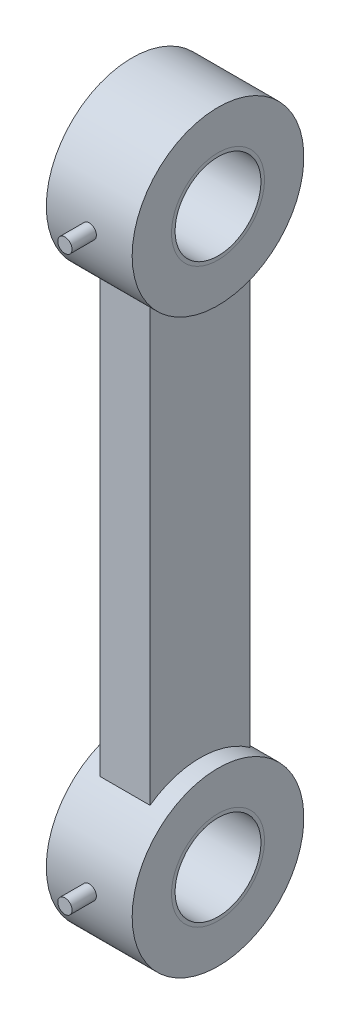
ISO-10303-21;
HEADER;
FILE_DESCRIPTION(('STEP AP214'),'2;1');
FILE_NAME('part.step','',(''),(''),'','','');
FILE_SCHEMA(('AUTOMOTIVE_DESIGN { 1 0 10303 214 1 1 1 1 }'));
ENDSEC;
DATA;
#1=APPLICATION_CONTEXT('core data for automotive mechanical design processes');
#2=APPLICATION_PROTOCOL_DEFINITION('international standard','automotive_design',2000,#1);
#3=PRODUCT_CONTEXT('',#1,'mechanical');
#4=PRODUCT('Part','Part','',(#3));
#5=PRODUCT_RELATED_PRODUCT_CATEGORY('part','',(#4));
#6=PRODUCT_DEFINITION_FORMATION('','',#4);
#7=PRODUCT_DEFINITION_CONTEXT('part definition',#1,'design');
#8=PRODUCT_DEFINITION('design','',#6,#7);
#9=PRODUCT_DEFINITION_SHAPE('','',#8);
#10=(LENGTH_UNIT() NAMED_UNIT(*) SI_UNIT(.MILLI.,.METRE.));
#11=(NAMED_UNIT(*) PLANE_ANGLE_UNIT() SI_UNIT($,.RADIAN.));
#12=(NAMED_UNIT(*) SI_UNIT($,.STERADIAN.) SOLID_ANGLE_UNIT());
#13=UNCERTAINTY_MEASURE_WITH_UNIT(LENGTH_MEASURE(1.E-05),#10,'distance_accuracy_value','');
#14=(GEOMETRIC_REPRESENTATION_CONTEXT(3) GLOBAL_UNCERTAINTY_ASSIGNED_CONTEXT((#13)) GLOBAL_UNIT_ASSIGNED_CONTEXT((#10,
#11,#12)) REPRESENTATION_CONTEXT('',''));
#15=CARTESIAN_POINT('',(0.,0.,0.));
#16=DIRECTION('',(0.,0.,1.));
#17=DIRECTION('',(1.,0.,0.));
#18=AXIS2_PLACEMENT_3D('',#15,#16,#17);
#19=CARTESIAN_POINT('',(869.,50.,1100.));
#20=DIRECTION('',(1.,0.,0.));
#21=DIRECTION('',(0.,0.,1.));
#22=AXIS2_PLACEMENT_3D('',#19,#20,#21);
#23=CYLINDRICAL_SURFACE('',#22,30.);
#24=CARTESIAN_POINT('',(930.,50.,1100.));
#25=DIRECTION('',(1.,0.,0.));
#26=DIRECTION('',(0.,0.,1.));
#27=AXIS2_PLACEMENT_3D('',#24,#25,#26);
#28=CIRCLE('',#27,30.);
#29=CARTESIAN_POINT('',(930.,50.,1130.));
#30=VERTEX_POINT('',#29);
#31=EDGE_CURVE('P0_E22',#30,#30,#28,.T.);
#32=ORIENTED_EDGE('',*,*,#31,.T.);
#33=EDGE_LOOP('',(#32));
#34=FACE_BOUND('',#33,.T.);
#35=CARTESIAN_POINT('',(870.,50.,1100.));
#36=DIRECTION('',(1.,0.,0.));
#37=DIRECTION('',(0.,0.,1.));
#38=AXIS2_PLACEMENT_3D('',#35,#36,#37);
#39=CIRCLE('',#38,30.);
#40=CARTESIAN_POINT('',(870.,50.,1130.));
#41=VERTEX_POINT('',#40);
#42=EDGE_CURVE('P0_E10',#41,#41,#39,.T.);
#43=ORIENTED_EDGE('',*,*,#42,.F.);
#44=EDGE_LOOP('',(#43));
#45=FACE_BOUND('',#44,.T.);
#46=ADVANCED_FACE('P0_F15',(#34,#45),#23,.F.);
#47=CARTESIAN_POINT('',(870.,50.,1100.));
#48=DIRECTION('',(1.,0.,0.));
#49=DIRECTION('',(0.,1.,0.));
#50=AXIS2_PLACEMENT_3D('',#47,#48,#49);
#51=PLANE('',#50);
#52=ORIENTED_EDGE('',*,*,#42,.T.);
#53=EDGE_LOOP('',(#52));
#54=FACE_BOUND('',#53,.T.);
#55=CARTESIAN_POINT('',(870.,50.,1100.));
#56=DIRECTION('',(1.,0.,0.));
#57=DIRECTION('',(0.,0.,1.));
#58=AXIS2_PLACEMENT_3D('',#55,#56,#57);
#59=CIRCLE('',#58,32.5);
#60=CARTESIAN_POINT('',(870.,50.,1132.5));
#61=VERTEX_POINT('',#60);
#62=EDGE_CURVE('P0_E28',#61,#61,#59,.T.);
#63=ORIENTED_EDGE('',*,*,#62,.F.);
#64=EDGE_LOOP('',(#63));
#65=FACE_BOUND('',#64,.T.);
#66=ADVANCED_FACE('P0_F55',(#54,#65),#51,.F.);
#67=CARTESIAN_POINT('',(930.,50.,1100.));
#68=DIRECTION('',(1.,0.,0.));
#69=DIRECTION('',(0.,1.,0.));
#70=AXIS2_PLACEMENT_3D('',#67,#68,#69);
#71=PLANE('',#70);
#72=ORIENTED_EDGE('',*,*,#31,.F.);
#73=EDGE_LOOP('',(#72));
#74=FACE_BOUND('',#73,.T.);
#75=CARTESIAN_POINT('',(930.,50.,1100.));
#76=DIRECTION('',(1.,0.,0.));
#77=DIRECTION('',(0.,0.,1.));
#78=AXIS2_PLACEMENT_3D('',#75,#76,#77);
#79=CIRCLE('',#78,32.5);
#80=CARTESIAN_POINT('',(930.,50.,1132.5));
#81=VERTEX_POINT('',#80);
#82=EDGE_CURVE('P0_E38',#81,#81,#79,.T.);
#83=ORIENTED_EDGE('',*,*,#82,.T.);
#84=EDGE_LOOP('',(#83));
#85=FACE_BOUND('',#84,.T.);
#86=ADVANCED_FACE('P0_F42',(#74,#85),#71,.T.);
#87=CARTESIAN_POINT('',(870.,50.,1100.));
#88=DIRECTION('',(1.,0.,0.));
#89=DIRECTION('',(0.,0.,1.));
#90=AXIS2_PLACEMENT_3D('',#87,#88,#89);
#91=CYLINDRICAL_SURFACE('',#90,32.5);
#92=ORIENTED_EDGE('',*,*,#82,.F.);
#93=EDGE_LOOP('',(#92));
#94=FACE_BOUND('',#93,.T.);
#95=ORIENTED_EDGE('',*,*,#62,.T.);
#96=EDGE_LOOP('',(#95));
#97=FACE_BOUND('',#96,.T.);
#98=ADVANCED_FACE('P0_F46',(#94,#97),#91,.T.);
#99=CLOSED_SHELL('',(#46,#66,#86,#98));
#100=MANIFOLD_SOLID_BREP('P0_B1',#99);
#101=CARTESIAN_POINT('',(869.,-350.,1100.));
#102=DIRECTION('',(1.,0.,0.));
#103=DIRECTION('',(0.,0.,1.));
#104=AXIS2_PLACEMENT_3D('',#101,#102,#103);
#105=CYLINDRICAL_SURFACE('',#104,30.);
#106=CARTESIAN_POINT('',(930.,-350.,1100.));
#107=DIRECTION('',(1.,0.,0.));
#108=DIRECTION('',(0.,0.,1.));
#109=AXIS2_PLACEMENT_3D('',#106,#107,#108);
#110=CIRCLE('',#109,30.);
#111=CARTESIAN_POINT('',(930.,-350.,1130.));
#112=VERTEX_POINT('',#111);
#113=EDGE_CURVE('P1_E22',#112,#112,#110,.T.);
#114=ORIENTED_EDGE('',*,*,#113,.T.);
#115=EDGE_LOOP('',(#114));
#116=FACE_BOUND('',#115,.T.);
#117=CARTESIAN_POINT('',(870.,-350.,1100.));
#118=DIRECTION('',(1.,0.,0.));
#119=DIRECTION('',(0.,0.,1.));
#120=AXIS2_PLACEMENT_3D('',#117,#118,#119);
#121=CIRCLE('',#120,30.);
#122=CARTESIAN_POINT('',(870.,-350.,1130.));
#123=VERTEX_POINT('',#122);
#124=EDGE_CURVE('P1_E10',#123,#123,#121,.T.);
#125=ORIENTED_EDGE('',*,*,#124,.F.);
#126=EDGE_LOOP('',(#125));
#127=FACE_BOUND('',#126,.T.);
#128=ADVANCED_FACE('P1_F15',(#116,#127),#105,.F.);
#129=CARTESIAN_POINT('',(870.,-350.,1100.));
#130=DIRECTION('',(1.,0.,0.));
#131=DIRECTION('',(0.,1.,0.));
#132=AXIS2_PLACEMENT_3D('',#129,#130,#131);
#133=PLANE('',#132);
#134=ORIENTED_EDGE('',*,*,#124,.T.);
#135=EDGE_LOOP('',(#134));
#136=FACE_BOUND('',#135,.T.);
#137=CARTESIAN_POINT('',(870.,-350.,1100.));
#138=DIRECTION('',(1.,0.,0.));
#139=DIRECTION('',(0.,0.,1.));
#140=AXIS2_PLACEMENT_3D('',#137,#138,#139);
#141=CIRCLE('',#140,32.5);
#142=CARTESIAN_POINT('',(870.,-350.,1132.5));
#143=VERTEX_POINT('',#142);
#144=EDGE_CURVE('P1_E28',#143,#143,#141,.T.);
#145=ORIENTED_EDGE('',*,*,#144,.F.);
#146=EDGE_LOOP('',(#145));
#147=FACE_BOUND('',#146,.T.);
#148=ADVANCED_FACE('P1_F55',(#136,#147),#133,.F.);
#149=CARTESIAN_POINT('',(930.,-350.,1100.));
#150=DIRECTION('',(1.,0.,0.));
#151=DIRECTION('',(0.,1.,0.));
#152=AXIS2_PLACEMENT_3D('',#149,#150,#151);
#153=PLANE('',#152);
#154=ORIENTED_EDGE('',*,*,#113,.F.);
#155=EDGE_LOOP('',(#154));
#156=FACE_BOUND('',#155,.T.);
#157=CARTESIAN_POINT('',(930.,-350.,1100.));
#158=DIRECTION('',(1.,0.,0.));
#159=DIRECTION('',(0.,0.,1.));
#160=AXIS2_PLACEMENT_3D('',#157,#158,#159);
#161=CIRCLE('',#160,32.5);
#162=CARTESIAN_POINT('',(930.,-350.,1132.5));
#163=VERTEX_POINT('',#162);
#164=EDGE_CURVE('P1_E38',#163,#163,#161,.T.);
#165=ORIENTED_EDGE('',*,*,#164,.T.);
#166=EDGE_LOOP('',(#165));
#167=FACE_BOUND('',#166,.T.);
#168=ADVANCED_FACE('P1_F42',(#156,#167),#153,.T.);
#169=CARTESIAN_POINT('',(870.,-350.,1100.));
#170=DIRECTION('',(1.,0.,0.));
#171=DIRECTION('',(0.,0.,1.));
#172=AXIS2_PLACEMENT_3D('',#169,#170,#171);
#173=CYLINDRICAL_SURFACE('',#172,32.5);
#174=ORIENTED_EDGE('',*,*,#164,.F.);
#175=EDGE_LOOP('',(#174));
#176=FACE_BOUND('',#175,.T.);
#177=ORIENTED_EDGE('',*,*,#144,.T.);
#178=EDGE_LOOP('',(#177));
#179=FACE_BOUND('',#178,.T.);
#180=ADVANCED_FACE('P1_F46',(#176,#179),#173,.T.);
#181=CLOSED_SHELL('',(#128,#148,#168,#180));
#182=MANIFOLD_SOLID_BREP('P1_B1',#181);
#183=CARTESIAN_POINT('',(868.,-350.,1100.));
#184=DIRECTION('',(1.,0.,0.));
#185=DIRECTION('',(0.,0.,1.));
#186=AXIS2_PLACEMENT_3D('',#183,#184,#185);
#187=CYLINDRICAL_SURFACE('',#186,32.5);
#188=CARTESIAN_POINT('',(930.,-350.,1100.));
#189=DIRECTION('',(1.,0.,0.));
#190=DIRECTION('',(0.,0.,1.));
#191=AXIS2_PLACEMENT_3D('',#188,#189,#190);
#192=CIRCLE('',#191,32.5);
#193=CARTESIAN_POINT('',(930.,-350.,1132.5));
#194=VERTEX_POINT('',#193);
#195=EDGE_CURVE('P2_E11',#194,#194,#192,.T.);
#196=ORIENTED_EDGE('',*,*,#195,.T.);
#197=EDGE_LOOP('',(#196));
#198=FACE_BOUND('',#197,.T.);
#199=CARTESIAN_POINT('',(870.,-350.,1100.));
#200=DIRECTION('',(1.,0.,0.));
#201=DIRECTION('',(0.,0.,1.));
#202=AXIS2_PLACEMENT_3D('',#199,#200,#201);
#203=CIRCLE('',#202,32.5);
#204=CARTESIAN_POINT('',(870.,-350.,1132.5));
#205=VERTEX_POINT('',#204);
#206=EDGE_CURVE('P2_E27',#205,#205,#203,.T.);
#207=ORIENTED_EDGE('',*,*,#206,.F.);
#208=EDGE_LOOP('',(#207));
#209=FACE_BOUND('',#208,.T.);
#210=ADVANCED_FACE('P2_F17',(#198,#209),#187,.F.);
#211=CARTESIAN_POINT('',(868.,50.,1100.));
#212=DIRECTION('',(1.,0.,0.));
#213=DIRECTION('',(0.,0.,1.));
#214=AXIS2_PLACEMENT_3D('',#211,#212,#213);
#215=CYLINDRICAL_SURFACE('',#214,32.5);
#216=CARTESIAN_POINT('',(930.,50.,1100.));
#217=DIRECTION('',(1.,0.,0.));
#218=DIRECTION('',(0.,0.,1.));
#219=AXIS2_PLACEMENT_3D('',#216,#217,#218);
#220=CIRCLE('',#219,32.5);
#221=CARTESIAN_POINT('',(930.,50.,1132.5));
#222=VERTEX_POINT('',#221);
#223=EDGE_CURVE('P2_E119',#222,#222,#220,.T.);
#224=ORIENTED_EDGE('',*,*,#223,.T.);
#225=EDGE_LOOP('',(#224));
#226=FACE_BOUND('',#225,.T.);
#227=CARTESIAN_POINT('',(870.,50.,1100.));
#228=DIRECTION('',(1.,0.,0.));
#229=DIRECTION('',(0.,0.,1.));
#230=AXIS2_PLACEMENT_3D('',#227,#228,#229);
#231=CIRCLE('',#230,32.5);
#232=CARTESIAN_POINT('',(870.,50.,1132.5));
#233=VERTEX_POINT('',#232);
#234=EDGE_CURVE('P2_E73',#233,#233,#231,.T.);
#235=ORIENTED_EDGE('',*,*,#234,.F.);
#236=EDGE_LOOP('',(#235));
#237=FACE_BOUND('',#236,.T.);
#238=ADVANCED_FACE('P2_F168',(#226,#237),#215,.F.);
#239=CARTESIAN_POINT('',(930.,-350.,1100.));
#240=DIRECTION('',(1.,0.,0.));
#241=DIRECTION('',(0.,1.,0.));
#242=AXIS2_PLACEMENT_3D('',#239,#240,#241);
#243=PLANE('',#242);
#244=ORIENTED_EDGE('',*,*,#195,.F.);
#245=EDGE_LOOP('',(#244));
#246=FACE_BOUND('',#245,.T.);
#247=CARTESIAN_POINT('',(930.,-350.,1100.));
#248=DIRECTION('',(1.,0.,0.));
#249=DIRECTION('',(0.,0.,1.));
#250=AXIS2_PLACEMENT_3D('',#247,#248,#249);
#251=CIRCLE('',#250,60.);
#252=CARTESIAN_POINT('',(930.,-350.,1160.));
#253=VERTEX_POINT('',#252);
#254=EDGE_CURVE('P2_E104',#253,#253,#251,.T.);
#255=ORIENTED_EDGE('',*,*,#254,.T.);
#256=EDGE_LOOP('',(#255));
#257=FACE_BOUND('',#256,.T.);
#258=ADVANCED_FACE('P2_F175',(#246,#257),#243,.T.);
#259=CARTESIAN_POINT('',(870.,-350.,1100.));
#260=DIRECTION('',(1.,0.,0.));
#261=DIRECTION('',(0.,1.,0.));
#262=AXIS2_PLACEMENT_3D('',#259,#260,#261);
#263=PLANE('',#262);
#264=ORIENTED_EDGE('',*,*,#206,.T.);
#265=EDGE_LOOP('',(#264));
#266=FACE_BOUND('',#265,.T.);
#267=CARTESIAN_POINT('',(870.,-350.,1100.));
#268=DIRECTION('',(1.,0.,0.));
#269=DIRECTION('',(0.,0.,1.));
#270=AXIS2_PLACEMENT_3D('',#267,#268,#269);
#271=CIRCLE('',#270,60.);
#272=CARTESIAN_POINT('',(870.,-350.,1160.));
#273=VERTEX_POINT('',#272);
#274=EDGE_CURVE('P2_E72',#273,#273,#271,.T.);
#275=ORIENTED_EDGE('',*,*,#274,.F.);
#276=EDGE_LOOP('',(#275));
#277=FACE_BOUND('',#276,.T.);
#278=ADVANCED_FACE('P2_F185',(#266,#277),#263,.F.);
#279=CARTESIAN_POINT('',(930.,50.,1100.));
#280=DIRECTION('',(1.,0.,0.));
#281=DIRECTION('',(0.,1.,0.));
#282=AXIS2_PLACEMENT_3D('',#279,#280,#281);
#283=PLANE('',#282);
#284=ORIENTED_EDGE('',*,*,#223,.F.);
#285=EDGE_LOOP('',(#284));
#286=FACE_BOUND('',#285,.T.);
#287=CARTESIAN_POINT('',(930.,50.,1100.));
#288=DIRECTION('',(1.,0.,0.));
#289=DIRECTION('',(0.,0.,1.));
#290=AXIS2_PLACEMENT_3D('',#287,#288,#289);
#291=CIRCLE('',#290,60.);
#292=CARTESIAN_POINT('',(930.,50.,1160.));
#293=VERTEX_POINT('',#292);
#294=EDGE_CURVE('P2_E105',#293,#293,#291,.T.);
#295=ORIENTED_EDGE('',*,*,#294,.T.);
#296=EDGE_LOOP('',(#295));
#297=FACE_BOUND('',#296,.T.);
#298=ADVANCED_FACE('P2_F203',(#286,#297),#283,.T.);
#299=CARTESIAN_POINT('',(870.,50.,1100.));
#300=DIRECTION('',(1.,0.,0.));
#301=DIRECTION('',(0.,1.,0.));
#302=AXIS2_PLACEMENT_3D('',#299,#300,#301);
#303=PLANE('',#302);
#304=ORIENTED_EDGE('',*,*,#234,.T.);
#305=EDGE_LOOP('',(#304));
#306=FACE_BOUND('',#305,.T.);
#307=CARTESIAN_POINT('',(870.,50.,1100.));
#308=DIRECTION('',(1.,0.,0.));
#309=DIRECTION('',(0.,0.,1.));
#310=AXIS2_PLACEMENT_3D('',#307,#308,#309);
#311=CIRCLE('',#310,60.);
#312=CARTESIAN_POINT('',(870.,50.,1160.));
#313=VERTEX_POINT('',#312);
#314=EDGE_CURVE('P2_E108',#313,#313,#311,.T.);
#315=ORIENTED_EDGE('',*,*,#314,.F.);
#316=EDGE_LOOP('',(#315));
#317=FACE_BOUND('',#316,.T.);
#318=ADVANCED_FACE('P2_F198',(#306,#317),#303,.F.);
#319=CARTESIAN_POINT('',(917.5,-350.,1065.));
#320=DIRECTION('',(1.,0.,0.));
#321=DIRECTION('',(0.,1.,0.));
#322=AXIS2_PLACEMENT_3D('',#319,#320,#321);
#323=PLANE('',#322);
#324=DIRECTION('',(0.,1.,0.));
#325=VECTOR('',#324,1.);
#326=CARTESIAN_POINT('',(917.5,-350.,1135.));
#327=LINE('',#326,#325);
#328=CARTESIAN_POINT('',(917.5,-301.2660282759,1135.));
#329=VERTEX_POINT('',#328);
#330=CARTESIAN_POINT('',(917.5,1.266028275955,1135.));
#331=VERTEX_POINT('',#330);
#332=EDGE_CURVE('P2_E80',#329,#331,#327,.T.);
#333=ORIENTED_EDGE('',*,*,#332,.F.);
#334=CARTESIAN_POINT('',(917.5,-350.,1100.));
#335=DIRECTION('',(1.,0.,0.));
#336=DIRECTION('',(0.,0.,1.));
#337=AXIS2_PLACEMENT_3D('',#334,#335,#336);
#338=CIRCLE('',#337,60.);
#339=CARTESIAN_POINT('',(917.5,-301.2660282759,1065.));
#340=VERTEX_POINT('',#339);
#341=EDGE_CURVE('P2_E40',#340,#329,#338,.T.);
#342=ORIENTED_EDGE('',*,*,#341,.F.);
#343=DIRECTION('',(0.,1.,0.));
#344=VECTOR('',#343,1.);
#345=CARTESIAN_POINT('',(917.5,-350.,1065.));
#346=LINE('',#345,#344);
#347=CARTESIAN_POINT('',(917.5,1.266028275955,1065.));
#348=VERTEX_POINT('',#347);
#349=EDGE_CURVE('P2_E98',#340,#348,#346,.T.);
#350=ORIENTED_EDGE('',*,*,#349,.T.);
#351=CARTESIAN_POINT('',(917.5,50.,1100.));
#352=DIRECTION('',(1.,0.,0.));
#353=DIRECTION('',(0.,0.,1.));
#354=AXIS2_PLACEMENT_3D('',#351,#352,#353);
#355=CIRCLE('',#354,60.);
#356=EDGE_CURVE('P2_E79',#331,#348,#355,.T.);
#357=ORIENTED_EDGE('',*,*,#356,.F.);
#358=EDGE_LOOP('',(#333,#342,#350,#357));
#359=FACE_BOUND('',#358,.T.);
#360=ADVANCED_FACE('P2_F77',(#359),#323,.T.);
#361=CARTESIAN_POINT('',(870.,-350.,1100.));
#362=DIRECTION('',(1.,0.,0.));
#363=DIRECTION('',(0.,0.,1.));
#364=AXIS2_PLACEMENT_3D('',#361,#362,#363);
#365=CYLINDRICAL_SURFACE('',#364,60.);
#366=ORIENTED_EDGE('',*,*,#254,.F.);
#367=EDGE_LOOP('',(#366));
#368=FACE_BOUND('',#367,.T.);
#369=CARTESIAN_POINT('',(882.5,-350.,1100.));
#370=DIRECTION('',(1.,0.,0.));
#371=DIRECTION('',(0.,0.,1.));
#372=AXIS2_PLACEMENT_3D('',#369,#370,#371);
#373=CIRCLE('',#372,60.);
#374=CARTESIAN_POINT('',(882.5,-301.2660282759,1065.));
#375=VERTEX_POINT('',#374);
#376=CARTESIAN_POINT('',(882.5,-301.2660282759,1135.));
#377=VERTEX_POINT('',#376);
#378=EDGE_CURVE('P2_E92',#375,#377,#373,.T.);
#379=ORIENTED_EDGE('',*,*,#378,.F.);
#380=DIRECTION('',(1.,0.,0.));
#381=VECTOR('',#380,1.);
#382=CARTESIAN_POINT('',(870.,-301.2660282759,1065.));
#383=LINE('',#382,#381);
#384=EDGE_CURVE('P2_E68',#375,#340,#383,.T.);
#385=ORIENTED_EDGE('',*,*,#384,.T.);
#386=ORIENTED_EDGE('',*,*,#341,.T.);
#387=DIRECTION('',(1.,0.,0.));
#388=VECTOR('',#387,1.);
#389=CARTESIAN_POINT('',(870.,-301.2660282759,1135.));
#390=LINE('',#389,#388);
#391=EDGE_CURVE('P2_E69',#377,#329,#390,.T.);
#392=ORIENTED_EDGE('',*,*,#391,.F.);
#393=EDGE_LOOP('',(#379,#385,#386,#392));
#394=FACE_BOUND('',#393,.T.);
#395=ORIENTED_EDGE('',*,*,#274,.T.);
#396=EDGE_LOOP('',(#395));
#397=FACE_BOUND('',#396,.T.);
#398=ADVANCED_FACE('P2_F65',(#368,#394,#397),#365,.T.);
#399=CARTESIAN_POINT('',(882.5,-350.,1065.));
#400=DIRECTION('',(0.,0.,1.));
#401=DIRECTION('',(1.,0.,0.));
#402=AXIS2_PLACEMENT_3D('',#399,#400,#401);
#403=PLANE('',#402);
#404=DIRECTION('',(1.,0.,0.));
#405=VECTOR('',#404,1.);
#406=CARTESIAN_POINT('',(870.,1.266028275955,1065.));
#407=LINE('',#406,#405);
#408=CARTESIAN_POINT('',(882.5,1.266028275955,1065.));
#409=VERTEX_POINT('',#408);
#410=EDGE_CURVE('P2_E153',#409,#348,#407,.T.);
#411=ORIENTED_EDGE('',*,*,#410,.T.);
#412=ORIENTED_EDGE('',*,*,#349,.F.);
#413=ORIENTED_EDGE('',*,*,#384,.F.);
#414=DIRECTION('',(0.,1.,0.));
#415=VECTOR('',#414,1.);
#416=CARTESIAN_POINT('',(882.5,-350.,1065.));
#417=LINE('',#416,#415);
#418=EDGE_CURVE('P2_E133',#375,#409,#417,.T.);
#419=ORIENTED_EDGE('',*,*,#418,.T.);
#420=EDGE_LOOP('',(#411,#412,#413,#419));
#421=FACE_BOUND('',#420,.T.);
#422=ADVANCED_FACE('P2_F189',(#421),#403,.F.);
#423=CARTESIAN_POINT('',(870.,50.,1100.));
#424=DIRECTION('',(1.,0.,0.));
#425=DIRECTION('',(0.,0.,1.));
#426=AXIS2_PLACEMENT_3D('',#423,#424,#425);
#427=CYLINDRICAL_SURFACE('',#426,60.);
#428=ORIENTED_EDGE('',*,*,#294,.F.);
#429=EDGE_LOOP('',(#428));
#430=FACE_BOUND('',#429,.T.);
#431=CARTESIAN_POINT('',(882.5,50.,1100.));
#432=DIRECTION('',(1.,0.,0.));
#433=DIRECTION('',(0.,0.,1.));
#434=AXIS2_PLACEMENT_3D('',#431,#432,#433);
#435=CIRCLE('',#434,60.);
#436=CARTESIAN_POINT('',(882.5,1.266028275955,1135.));
#437=VERTEX_POINT('',#436);
#438=EDGE_CURVE('P2_E138',#437,#409,#435,.T.);
#439=ORIENTED_EDGE('',*,*,#438,.F.);
#440=DIRECTION('',(1.,0.,0.));
#441=VECTOR('',#440,1.);
#442=CARTESIAN_POINT('',(870.,1.266028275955,1135.));
#443=LINE('',#442,#441);
#444=EDGE_CURVE('P2_E81',#437,#331,#443,.T.);
#445=ORIENTED_EDGE('',*,*,#444,.T.);
#446=ORIENTED_EDGE('',*,*,#356,.T.);
#447=ORIENTED_EDGE('',*,*,#410,.F.);
#448=EDGE_LOOP('',(#439,#445,#446,#447));
#449=FACE_BOUND('',#448,.T.);
#450=ORIENTED_EDGE('',*,*,#314,.T.);
#451=EDGE_LOOP('',(#450));
#452=FACE_BOUND('',#451,.T.);
#453=ADVANCED_FACE('P2_F158',(#430,#449,#452),#427,.T.);
#454=CARTESIAN_POINT('',(882.5,-350.,1135.));
#455=DIRECTION('',(0.,0.,1.));
#456=DIRECTION('',(1.,0.,0.));
#457=AXIS2_PLACEMENT_3D('',#454,#455,#456);
#458=PLANE('',#457);
#459=DIRECTION('',(0.,1.,0.));
#460=VECTOR('',#459,1.);
#461=CARTESIAN_POINT('',(882.5,-350.,1135.));
#462=LINE('',#461,#460);
#463=EDGE_CURVE('P2_E86',#377,#437,#462,.T.);
#464=ORIENTED_EDGE('',*,*,#463,.F.);
#465=ORIENTED_EDGE('',*,*,#391,.T.);
#466=ORIENTED_EDGE('',*,*,#332,.T.);
#467=ORIENTED_EDGE('',*,*,#444,.F.);
#468=EDGE_LOOP('',(#464,#465,#466,#467));
#469=FACE_BOUND('',#468,.T.);
#470=ADVANCED_FACE('P2_F88',(#469),#458,.T.);
#471=CARTESIAN_POINT('',(882.5,-350.,1065.));
#472=DIRECTION('',(1.,0.,0.));
#473=DIRECTION('',(0.,1.,0.));
#474=AXIS2_PLACEMENT_3D('',#471,#472,#473);
#475=PLANE('',#474);
#476=ORIENTED_EDGE('',*,*,#438,.T.);
#477=ORIENTED_EDGE('',*,*,#418,.F.);
#478=ORIENTED_EDGE('',*,*,#378,.T.);
#479=ORIENTED_EDGE('',*,*,#463,.T.);
#480=EDGE_LOOP('',(#476,#477,#478,#479));
#481=FACE_BOUND('',#480,.T.);
#482=ADVANCED_FACE('P2_F159',(#481),#475,.F.);
#483=CLOSED_SHELL('',(#210,#238,#258,#278,#298,#318,#360,#398,#422,#453,#470,#482));
#484=MANIFOLD_SOLID_BREP('P2_B1',#483);
#485=CARTESIAN_POINT('',(900.,50.,1160.));
#486=DIRECTION('',(0.,0.,1.));
#487=DIRECTION('',(1.,0.,0.));
#488=AXIS2_PLACEMENT_3D('',#485,#486,#487);
#489=PLANE('',#488);
#490=CARTESIAN_POINT('',(900.,50.,1160.));
#491=DIRECTION('',(0.,0.,1.));
#492=DIRECTION('',(1.,0.,0.));
#493=AXIS2_PLACEMENT_3D('',#490,#491,#492);
#494=CIRCLE('',#493,5.);
#495=CARTESIAN_POINT('',(905.,50.,1160.));
#496=VERTEX_POINT('',#495);
#497=EDGE_CURVE('P3_E10',#496,#496,#494,.T.);
#498=ORIENTED_EDGE('',*,*,#497,.F.);
#499=EDGE_LOOP('',(#498));
#500=FACE_BOUND('',#499,.T.);
#501=ADVANCED_FACE('P3_F15',(#500),#489,.F.);
#502=CARTESIAN_POINT('',(900.,50.,1177.));
#503=DIRECTION('',(0.,0.,1.));
#504=DIRECTION('',(1.,0.,0.));
#505=AXIS2_PLACEMENT_3D('',#502,#503,#504);
#506=PLANE('',#505);
#507=CARTESIAN_POINT('',(900.,50.,1177.));
#508=DIRECTION('',(0.,0.,1.));
#509=DIRECTION('',(1.,0.,0.));
#510=AXIS2_PLACEMENT_3D('',#507,#508,#509);
#511=CIRCLE('',#510,5.);
#512=CARTESIAN_POINT('',(905.,50.,1177.));
#513=VERTEX_POINT('',#512);
#514=EDGE_CURVE('P3_E22',#513,#513,#511,.T.);
#515=ORIENTED_EDGE('',*,*,#514,.T.);
#516=EDGE_LOOP('',(#515));
#517=FACE_BOUND('',#516,.T.);
#518=ADVANCED_FACE('P3_F31',(#517),#506,.T.);
#519=CARTESIAN_POINT('',(900.,50.,1160.));
#520=DIRECTION('',(0.,0.,1.));
#521=DIRECTION('',(1.,0.,0.));
#522=AXIS2_PLACEMENT_3D('',#519,#520,#521);
#523=CYLINDRICAL_SURFACE('',#522,5.);
#524=ORIENTED_EDGE('',*,*,#514,.F.);
#525=EDGE_LOOP('',(#524));
#526=FACE_BOUND('',#525,.T.);
#527=ORIENTED_EDGE('',*,*,#497,.T.);
#528=EDGE_LOOP('',(#527));
#529=FACE_BOUND('',#528,.T.);
#530=ADVANCED_FACE('P3_F34',(#526,#529),#523,.T.);
#531=CLOSED_SHELL('',(#501,#518,#530));
#532=MANIFOLD_SOLID_BREP('P3_B1',#531);
#533=CARTESIAN_POINT('',(900.,-350.,1160.));
#534=DIRECTION('',(0.,0.,1.));
#535=DIRECTION('',(1.,0.,0.));
#536=AXIS2_PLACEMENT_3D('',#533,#534,#535);
#537=PLANE('',#536);
#538=CARTESIAN_POINT('',(900.,-350.,1160.));
#539=DIRECTION('',(0.,0.,1.));
#540=DIRECTION('',(1.,0.,0.));
#541=AXIS2_PLACEMENT_3D('',#538,#539,#540);
#542=CIRCLE('',#541,5.);
#543=CARTESIAN_POINT('',(905.,-350.,1160.));
#544=VERTEX_POINT('',#543);
#545=EDGE_CURVE('P4_E9',#544,#544,#542,.T.);
#546=ORIENTED_EDGE('',*,*,#545,.F.);
#547=EDGE_LOOP('',(#546));
#548=FACE_BOUND('',#547,.T.);
#549=ADVANCED_FACE('P4_F14',(#548),#537,.F.);
#550=CARTESIAN_POINT('',(900.,-350.,1177.));
#551=DIRECTION('',(0.,0.,1.));
#552=DIRECTION('',(1.,0.,0.));
#553=AXIS2_PLACEMENT_3D('',#550,#551,#552);
#554=PLANE('',#553);
#555=CARTESIAN_POINT('',(900.,-350.,1177.));
#556=DIRECTION('',(0.,0.,1.));
#557=DIRECTION('',(1.,0.,0.));
#558=AXIS2_PLACEMENT_3D('',#555,#556,#557);
#559=CIRCLE('',#558,5.);
#560=CARTESIAN_POINT('',(905.,-350.,1177.));
#561=VERTEX_POINT('',#560);
#562=EDGE_CURVE('P4_E21',#561,#561,#559,.T.);
#563=ORIENTED_EDGE('',*,*,#562,.T.);
#564=EDGE_LOOP('',(#563));
#565=FACE_BOUND('',#564,.T.);
#566=ADVANCED_FACE('P4_F32',(#565),#554,.T.);
#567=CARTESIAN_POINT('',(900.,-350.,1160.));
#568=DIRECTION('',(0.,0.,1.));
#569=DIRECTION('',(1.,0.,0.));
#570=AXIS2_PLACEMENT_3D('',#567,#568,#569);
#571=CYLINDRICAL_SURFACE('',#570,5.);
#572=ORIENTED_EDGE('',*,*,#562,.F.);
#573=EDGE_LOOP('',(#572));
#574=FACE_BOUND('',#573,.T.);
#575=ORIENTED_EDGE('',*,*,#545,.T.);
#576=EDGE_LOOP('',(#575));
#577=FACE_BOUND('',#576,.T.);
#578=ADVANCED_FACE('P4_F35',(#574,#577),#571,.T.);
#579=CLOSED_SHELL('',(#549,#566,#578));
#580=MANIFOLD_SOLID_BREP('P4_B1',#579);
#581=ADVANCED_BREP_SHAPE_REPRESENTATION('',(#18,#100,#182,#484,#532,#580),#14);
#582=SHAPE_DEFINITION_REPRESENTATION(#9,#581);
ENDSEC;
END-ISO-10303-21;
